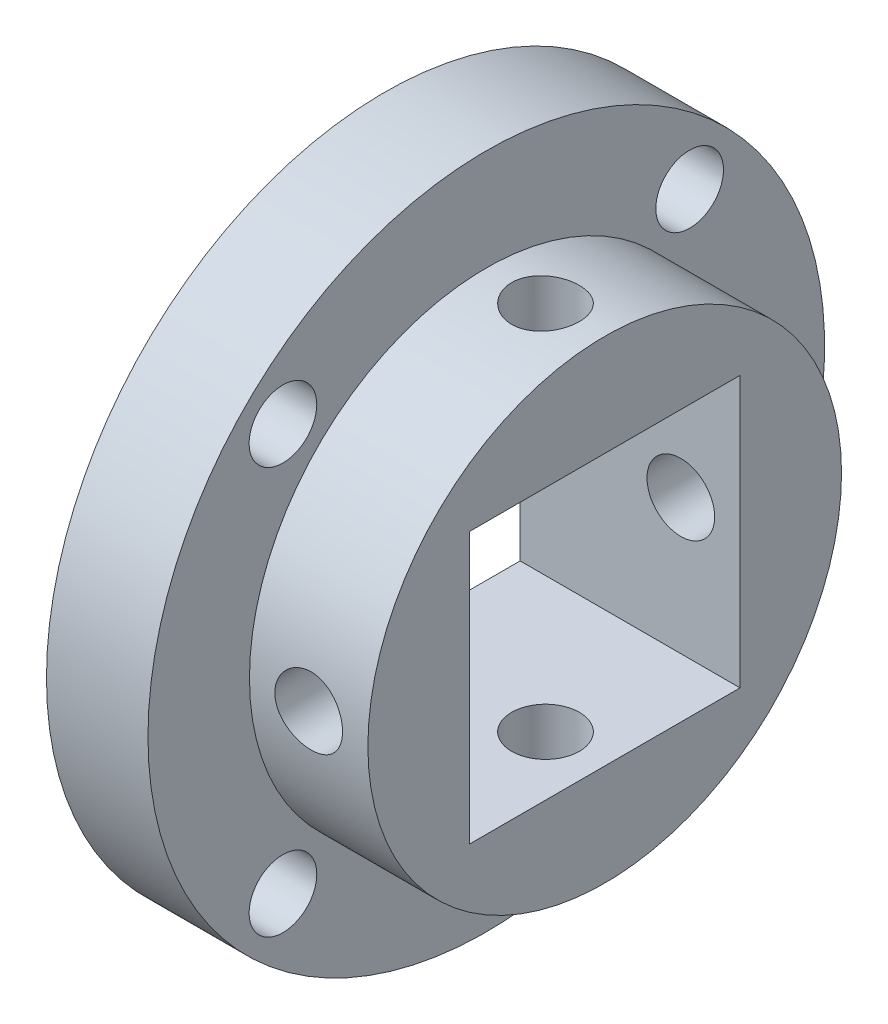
ISO-10303-21;
HEADER;
FILE_DESCRIPTION(('STEP AP214'),'2;1');
FILE_NAME('part.step','',(''),(''),'','','');
FILE_SCHEMA(('AUTOMOTIVE_DESIGN { 1 0 10303 214 1 1 1 1 }'));
ENDSEC;
DATA;
#1=APPLICATION_CONTEXT('core data for automotive mechanical design processes');
#2=APPLICATION_PROTOCOL_DEFINITION('international standard','automotive_design',2000,#1);
#3=PRODUCT_CONTEXT('',#1,'mechanical');
#4=PRODUCT('Part','Part','',(#3));
#5=PRODUCT_RELATED_PRODUCT_CATEGORY('part','',(#4));
#6=PRODUCT_DEFINITION_FORMATION('','',#4);
#7=PRODUCT_DEFINITION_CONTEXT('part definition',#1,'design');
#8=PRODUCT_DEFINITION('design','',#6,#7);
#9=PRODUCT_DEFINITION_SHAPE('','',#8);
#10=(LENGTH_UNIT() NAMED_UNIT(*) SI_UNIT(.MILLI.,.METRE.));
#11=(NAMED_UNIT(*) PLANE_ANGLE_UNIT() SI_UNIT($,.RADIAN.));
#12=(NAMED_UNIT(*) SI_UNIT($,.STERADIAN.) SOLID_ANGLE_UNIT());
#13=UNCERTAINTY_MEASURE_WITH_UNIT(LENGTH_MEASURE(1.E-05),#10,'distance_accuracy_value','');
#14=(GEOMETRIC_REPRESENTATION_CONTEXT(3) GLOBAL_UNCERTAINTY_ASSIGNED_CONTEXT((#13)) GLOBAL_UNIT_ASSIGNED_CONTEXT((#10,
#11,#12)) REPRESENTATION_CONTEXT('',''));
#15=CARTESIAN_POINT('',(0.,0.,0.));
#16=DIRECTION('',(0.,0.,1.));
#17=DIRECTION('',(1.,0.,0.));
#18=AXIS2_PLACEMENT_3D('',#15,#16,#17);
#19=CARTESIAN_POINT('',(0.,0.,0.));
#20=DIRECTION('',(1.,0.,0.));
#21=DIRECTION('',(0.,0.,-1.));
#22=AXIS2_PLACEMENT_3D('',#19,#20,#21);
#23=PLANE('',#22);
#24=CARTESIAN_POINT('',(0.,-12.0208152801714,12.0208152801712));
#25=DIRECTION('',(1.,0.,0.));
#26=DIRECTION('',(0.,0.,-1.));
#27=AXIS2_PLACEMENT_3D('',#24,#25,#26);
#28=CIRCLE('',#27,2.);
#29=CARTESIAN_POINT('',(0.,-12.0208152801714,10.0208152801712));
#30=VERTEX_POINT('',#29);
#31=EDGE_CURVE('E137',#30,#30,#28,.T.);
#32=ORIENTED_EDGE('',*,*,#31,.T.);
#33=EDGE_LOOP('',(#32));
#34=FACE_BOUND('',#33,.T.);
#35=CARTESIAN_POINT('',(0.,-12.0208152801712,-12.0208152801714));
#36=DIRECTION('',(1.,0.,0.));
#37=DIRECTION('',(0.,0.,-1.));
#38=AXIS2_PLACEMENT_3D('',#35,#36,#37);
#39=CIRCLE('',#38,2.);
#40=CARTESIAN_POINT('',(0.,-12.0208152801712,-14.0208152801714));
#41=VERTEX_POINT('',#40);
#42=EDGE_CURVE('E133',#41,#41,#39,.T.);
#43=ORIENTED_EDGE('',*,*,#42,.T.);
#44=EDGE_LOOP('',(#43));
#45=FACE_BOUND('',#44,.T.);
#46=CARTESIAN_POINT('',(0.,12.0208152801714,-12.0208152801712));
#47=DIRECTION('',(1.,0.,0.));
#48=DIRECTION('',(0.,0.,-1.));
#49=AXIS2_PLACEMENT_3D('',#46,#47,#48);
#50=CIRCLE('',#49,2.);
#51=CARTESIAN_POINT('',(0.,12.0208152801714,-14.0208152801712));
#52=VERTEX_POINT('',#51);
#53=EDGE_CURVE('E129',#52,#52,#50,.T.);
#54=ORIENTED_EDGE('',*,*,#53,.T.);
#55=EDGE_LOOP('',(#54));
#56=FACE_BOUND('',#55,.T.);
#57=CARTESIAN_POINT('',(0.,12.0208152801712,12.0208152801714));
#58=DIRECTION('',(1.,0.,0.));
#59=DIRECTION('',(0.,0.,-1.));
#60=AXIS2_PLACEMENT_3D('',#57,#58,#59);
#61=CIRCLE('',#60,2.);
#62=CARTESIAN_POINT('',(0.,12.0208152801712,10.0208152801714));
#63=VERTEX_POINT('',#62);
#64=EDGE_CURVE('E100',#63,#63,#61,.T.);
#65=ORIENTED_EDGE('',*,*,#64,.T.);
#66=EDGE_LOOP('',(#65));
#67=FACE_BOUND('',#66,.T.);
#68=DIRECTION('',(0.,0.,1.));
#69=VECTOR('',#68,1.);
#70=CARTESIAN_POINT('',(0.,8.,8.));
#71=LINE('',#70,#69);
#72=CARTESIAN_POINT('',(0.,8.,-8.));
#73=VERTEX_POINT('',#72);
#74=CARTESIAN_POINT('',(0.,8.,8.));
#75=VERTEX_POINT('',#74);
#76=EDGE_CURVE('E85',#73,#75,#71,.T.);
#77=ORIENTED_EDGE('',*,*,#76,.T.);
#78=DIRECTION('',(0.,-1.,0.));
#79=VECTOR('',#78,1.);
#80=CARTESIAN_POINT('',(0.,8.,8.));
#81=LINE('',#80,#79);
#82=CARTESIAN_POINT('',(0.,-8.,8.));
#83=VERTEX_POINT('',#82);
#84=EDGE_CURVE('E79',#75,#83,#81,.T.);
#85=ORIENTED_EDGE('',*,*,#84,.T.);
#86=DIRECTION('',(0.,0.,-1.));
#87=VECTOR('',#86,1.);
#88=CARTESIAN_POINT('',(0.,-8.,8.));
#89=LINE('',#88,#87);
#90=CARTESIAN_POINT('',(0.,-8.,-8.));
#91=VERTEX_POINT('',#90);
#92=EDGE_CURVE('E88',#83,#91,#89,.T.);
#93=ORIENTED_EDGE('',*,*,#92,.T.);
#94=DIRECTION('',(0.,1.,0.));
#95=VECTOR('',#94,1.);
#96=CARTESIAN_POINT('',(0.,8.,-8.));
#97=LINE('',#96,#95);
#98=EDGE_CURVE('E51',#91,#73,#97,.T.);
#99=ORIENTED_EDGE('',*,*,#98,.T.);
#100=EDGE_LOOP('',(#77,#85,#93,#99));
#101=FACE_BOUND('',#100,.T.);
#102=CARTESIAN_POINT('',(0.,0.,0.));
#103=DIRECTION('',(-1.,0.,0.));
#104=DIRECTION('',(0.,0.,1.));
#105=AXIS2_PLACEMENT_3D('',#102,#103,#104);
#106=CIRCLE('',#105,20.);
#107=CARTESIAN_POINT('',(0.,0.,20.));
#108=VERTEX_POINT('',#107);
#109=EDGE_CURVE('E11',#108,#108,#106,.T.);
#110=ORIENTED_EDGE('',*,*,#109,.T.);
#111=EDGE_LOOP('',(#110));
#112=FACE_BOUND('',#111,.T.);
#113=ADVANCED_FACE('F35',(#34,#45,#56,#67,#101,#112),#23,.F.);
#114=CARTESIAN_POINT('',(-19.0972157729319,0.,0.));
#115=DIRECTION('',(-1.,0.,0.));
#116=DIRECTION('',(0.,0.,1.));
#117=AXIS2_PLACEMENT_3D('',#114,#115,#116);
#118=CYLINDRICAL_SURFACE('',#117,20.);
#119=ORIENTED_EDGE('',*,*,#109,.F.);
#120=EDGE_LOOP('',(#119));
#121=FACE_BOUND('',#120,.T.);
#122=CARTESIAN_POINT('',(6.,0.,0.));
#123=DIRECTION('',(-1.,0.,0.));
#124=DIRECTION('',(0.,0.,1.));
#125=AXIS2_PLACEMENT_3D('',#122,#123,#124);
#126=CIRCLE('',#125,20.);
#127=CARTESIAN_POINT('',(6.,0.,20.));
#128=VERTEX_POINT('',#127);
#129=EDGE_CURVE('E43',#128,#128,#126,.T.);
#130=ORIENTED_EDGE('',*,*,#129,.T.);
#131=EDGE_LOOP('',(#130));
#132=FACE_BOUND('',#131,.T.);
#133=ADVANCED_FACE('F210',(#121,#132),#118,.T.);
#134=CARTESIAN_POINT('',(6.,-20.,1.39659253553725E-13));
#135=DIRECTION('',(-1.,0.,0.));
#136=DIRECTION('',(0.,0.,1.));
#137=AXIS2_PLACEMENT_3D('',#134,#135,#136);
#138=PLANE('',#137);
#139=CARTESIAN_POINT('',(6.,-12.0208152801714,12.0208152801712));
#140=DIRECTION('',(-1.,0.,0.));
#141=DIRECTION('',(0.,0.,1.));
#142=AXIS2_PLACEMENT_3D('',#139,#140,#141);
#143=CIRCLE('',#142,2.);
#144=CARTESIAN_POINT('',(6.,-12.0208152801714,14.0208152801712));
#145=VERTEX_POINT('',#144);
#146=EDGE_CURVE('E134',#145,#145,#143,.T.);
#147=ORIENTED_EDGE('',*,*,#146,.T.);
#148=EDGE_LOOP('',(#147));
#149=FACE_BOUND('',#148,.T.);
#150=CARTESIAN_POINT('',(6.,-12.0208152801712,-12.0208152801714));
#151=DIRECTION('',(-1.,0.,0.));
#152=DIRECTION('',(0.,0.,1.));
#153=AXIS2_PLACEMENT_3D('',#150,#151,#152);
#154=CIRCLE('',#153,2.);
#155=CARTESIAN_POINT('',(6.,-12.0208152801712,-10.0208152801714));
#156=VERTEX_POINT('',#155);
#157=EDGE_CURVE('E130',#156,#156,#154,.T.);
#158=ORIENTED_EDGE('',*,*,#157,.T.);
#159=EDGE_LOOP('',(#158));
#160=FACE_BOUND('',#159,.T.);
#161=CARTESIAN_POINT('',(6.,12.0208152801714,-12.0208152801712));
#162=DIRECTION('',(-1.,0.,0.));
#163=DIRECTION('',(0.,0.,1.));
#164=AXIS2_PLACEMENT_3D('',#161,#162,#163);
#165=CIRCLE('',#164,2.);
#166=CARTESIAN_POINT('',(6.,12.0208152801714,-10.0208152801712));
#167=VERTEX_POINT('',#166);
#168=EDGE_CURVE('E126',#167,#167,#165,.T.);
#169=ORIENTED_EDGE('',*,*,#168,.T.);
#170=EDGE_LOOP('',(#169));
#171=FACE_BOUND('',#170,.T.);
#172=CARTESIAN_POINT('',(6.,12.0208152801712,12.0208152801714));
#173=DIRECTION('',(-1.,0.,0.));
#174=DIRECTION('',(0.,0.,1.));
#175=AXIS2_PLACEMENT_3D('',#172,#173,#174);
#176=CIRCLE('',#175,2.);
#177=CARTESIAN_POINT('',(6.,12.0208152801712,14.0208152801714));
#178=VERTEX_POINT('',#177);
#179=EDGE_CURVE('E107',#178,#178,#176,.T.);
#180=ORIENTED_EDGE('',*,*,#179,.T.);
#181=EDGE_LOOP('',(#180));
#182=FACE_BOUND('',#181,.T.);
#183=ORIENTED_EDGE('',*,*,#129,.F.);
#184=EDGE_LOOP('',(#183));
#185=FACE_BOUND('',#184,.T.);
#186=CARTESIAN_POINT('',(6.,0.,0.));
#187=DIRECTION('',(-1.,0.,0.));
#188=DIRECTION('',(0.,0.,1.));
#189=AXIS2_PLACEMENT_3D('',#186,#187,#188);
#190=CIRCLE('',#189,14.);
#191=CARTESIAN_POINT('',(6.,0.,14.));
#192=VERTEX_POINT('',#191);
#193=EDGE_CURVE('E119',#192,#192,#190,.T.);
#194=ORIENTED_EDGE('',*,*,#193,.T.);
#195=EDGE_LOOP('',(#194));
#196=FACE_BOUND('',#195,.T.);
#197=ADVANCED_FACE('F207',(#149,#160,#171,#182,#185,#196),#138,.F.);
#198=CARTESIAN_POINT('',(-19.0972157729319,0.,0.));
#199=DIRECTION('',(-1.,0.,0.));
#200=DIRECTION('',(0.,0.,1.));
#201=AXIS2_PLACEMENT_3D('',#198,#199,#200);
#202=CYLINDRICAL_SURFACE('',#201,14.);
#203=CARTESIAN_POINT('',(11.5,0.,14.));
#204=CARTESIAN_POINT('',(11.4999953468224,-0.111730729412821,13.9999982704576));
#205=CARTESIAN_POINT('',(11.4906055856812,-0.223527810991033,13.9986484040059));
#206=CARTESIAN_POINT('',(11.453301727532,-0.44400132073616,13.9933934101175));
#207=CARTESIAN_POINT('',(11.4253691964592,-0.552674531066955,13.9894857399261));
#208=CARTESIAN_POINT('',(11.3518278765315,-0.763677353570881,13.9795546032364));
#209=CARTESIAN_POINT('',(11.306232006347,-0.866011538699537,13.9735326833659));
#210=CARTESIAN_POINT('',(11.1986889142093,-1.06155930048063,13.9600397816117));
#211=CARTESIAN_POINT('',(11.1367441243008,-1.15477423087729,13.9525690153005));
#212=CARTESIAN_POINT('',(10.9977916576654,-1.33011730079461,13.9369507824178));
#213=CARTESIAN_POINT('',(10.9206907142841,-1.41217118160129,13.9287993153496));
#214=CARTESIAN_POINT('',(10.7538151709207,-1.56222258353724,13.9127699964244));
#215=CARTESIAN_POINT('',(10.6640398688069,-1.63021932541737,13.9048921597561));
#216=CARTESIAN_POINT('',(10.4738697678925,-1.75051175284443,13.8902631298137));
#217=CARTESIAN_POINT('',(10.3734295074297,-1.80273625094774,13.8835171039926));
#218=CARTESIAN_POINT('',(10.1650909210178,-1.88954690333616,13.8719696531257));
#219=CARTESIAN_POINT('',(10.0571929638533,-1.92413392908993,13.8671681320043));
#220=CARTESIAN_POINT('',(9.83777998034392,-1.97445864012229,13.8600923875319));
#221=CARTESIAN_POINT('',(9.72629456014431,-1.99032297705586,13.8578011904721));
#222=CARTESIAN_POINT('',(9.50222218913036,-2.00314420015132,13.8559538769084));
#223=CARTESIAN_POINT('',(9.38963529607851,-2.00010207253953,13.8563976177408));
#224=CARTESIAN_POINT('',(9.16744690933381,-1.97530036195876,13.8599545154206));
#225=CARTESIAN_POINT('',(9.05782935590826,-1.95368136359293,13.8630476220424));
#226=CARTESIAN_POINT('',(8.84379382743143,-1.89255944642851,13.8715234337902));
#227=CARTESIAN_POINT('',(8.73937598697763,-1.85305606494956,13.8769061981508));
#228=CARTESIAN_POINT('',(8.53827345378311,-1.757139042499,13.8893771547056));
#229=CARTESIAN_POINT('',(8.44161777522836,-1.7006653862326,13.8964713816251));
#230=CARTESIAN_POINT('',(8.25910157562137,-1.57245369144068,13.9115614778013));
#231=CARTESIAN_POINT('',(8.17324169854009,-1.50071474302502,13.9195574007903));
#232=CARTESIAN_POINT('',(8.01393919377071,-1.34323491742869,13.935638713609));
#233=CARTESIAN_POINT('',(7.94061610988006,-1.25737307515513,13.9437242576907));
#234=CARTESIAN_POINT('',(7.80940299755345,-1.07449831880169,13.9590063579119));
#235=CARTESIAN_POINT('',(7.75151302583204,-0.977485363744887,13.9662029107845));
#236=CARTESIAN_POINT('',(7.6528051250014,-0.774962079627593,13.9789027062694));
#237=CARTESIAN_POINT('',(7.61199589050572,-0.669447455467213,13.9844050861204));
#238=CARTESIAN_POINT('',(7.5487090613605,-0.452966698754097,13.9930891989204));
#239=CARTESIAN_POINT('',(7.52623034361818,-0.342000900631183,13.9962710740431));
#240=CARTESIAN_POINT('',(7.50040037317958,-0.118800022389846,13.9999369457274));
#241=CARTESIAN_POINT('',(7.49688467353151,-0.00658433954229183,14.0004441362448));
#242=CARTESIAN_POINT('',(7.5086448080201,0.216834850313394,13.998766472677));
#243=CARTESIAN_POINT('',(7.5239201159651,0.328038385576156,13.9965816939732));
#244=CARTESIAN_POINT('',(7.57269194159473,0.545782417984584,13.989779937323));
#245=CARTESIAN_POINT('',(7.60610885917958,0.652341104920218,13.9851735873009));
#246=CARTESIAN_POINT('',(7.69013173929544,0.858342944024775,13.9740437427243));
#247=CARTESIAN_POINT('',(7.74073844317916,0.957785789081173,13.9675201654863));
#248=CARTESIAN_POINT('',(7.85809381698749,1.14745969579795,13.9532237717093));
#249=CARTESIAN_POINT('',(7.92494742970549,1.23762521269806,13.9454429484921));
#250=CARTESIAN_POINT('',(8.0727520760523,1.40551529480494,13.9295244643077));
#251=CARTESIAN_POINT('',(8.15370384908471,1.48323920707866,13.9213867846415));
#252=CARTESIAN_POINT('',(8.32813670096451,1.62463364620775,13.905598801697));
#253=CARTESIAN_POINT('',(8.42170727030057,1.68819430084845,13.8979526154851));
#254=CARTESIAN_POINT('',(8.61829318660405,1.79869568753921,13.8840847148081));
#255=CARTESIAN_POINT('',(8.72130829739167,1.8456368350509,13.8778629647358));
#256=CARTESIAN_POINT('',(8.93352330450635,1.92139410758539,13.8675777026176));
#257=CARTESIAN_POINT('',(9.04270175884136,1.95026930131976,13.8635071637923));
#258=CARTESIAN_POINT('',(9.26442056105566,1.98926373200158,13.8579660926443));
#259=CARTESIAN_POINT('',(9.37696069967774,1.99938413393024,13.8564953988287));
#260=CARTESIAN_POINT('',(9.60111382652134,2.00055590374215,13.8563261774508));
#261=CARTESIAN_POINT('',(9.71272593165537,1.9917799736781,13.8576025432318));
#262=CARTESIAN_POINT('',(9.93287012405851,1.95577695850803,13.8627292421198));
#263=CARTESIAN_POINT('',(10.0414022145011,1.92854989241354,13.8665795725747));
#264=CARTESIAN_POINT('',(10.2522652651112,1.85647645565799,13.8764118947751));
#265=CARTESIAN_POINT('',(10.3546000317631,1.81164102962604,13.8823925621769));
#266=CARTESIAN_POINT('',(10.5503224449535,1.7056406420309,13.8958134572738));
#267=CARTESIAN_POINT('',(10.6437098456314,1.64447523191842,13.9032537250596));
#268=CARTESIAN_POINT('',(10.819765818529,1.50691947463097,13.9188366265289));
#269=CARTESIAN_POINT('',(10.9023337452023,1.43040092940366,13.9269848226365));
#270=CARTESIAN_POINT('',(11.0535197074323,1.26458151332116,13.9430182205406));
#271=CARTESIAN_POINT('',(11.1221344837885,1.17527766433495,13.9509033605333));
#272=CARTESIAN_POINT('',(11.2437675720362,0.98590342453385,13.9655666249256));
#273=CARTESIAN_POINT('',(11.2967066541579,0.8857817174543,13.9723390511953));
#274=CARTESIAN_POINT('',(11.3849397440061,0.678021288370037,13.9839575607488));
#275=CARTESIAN_POINT('',(11.4202523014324,0.57039060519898,13.9888056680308));
#276=CARTESIAN_POINT('',(11.4640835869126,0.385211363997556,13.9949036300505));
#277=CARTESIAN_POINT('',(11.4775320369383,0.308813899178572,13.9968051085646));
#278=CARTESIAN_POINT('',(11.4954918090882,0.154954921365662,13.9993538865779));
#279=CARTESIAN_POINT('',(11.5000032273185,0.0774934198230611,14.0000011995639));
#280=CARTESIAN_POINT('',(11.5,0.,14.));
#281=B_SPLINE_CURVE_WITH_KNOTS('',3,(#203,#204,#205,#206,#207,#208,#209,#210,#211,#212,#213,
#214,#215,#216,#217,#218,#219,#220,#221,#222,#223,#224,#225,#226,#227,#228,#229,#230,#231,#232,
#233,#234,#235,#236,#237,#238,#239,#240,#241,#242,#243,#244,#245,#246,#247,#248,#249,#250,#251,
#252,#253,#254,#255,#256,#257,#258,#259,#260,#261,#262,#263,#264,#265,#266,#267,#268,#269,#270,
#271,#272,#273,#274,#275,#276,#277,#278,#279,#280),.UNSPECIFIED.,.T.,.F.,(4,2,2,2,2,2,2,2,2,2,2,
2,2,2,2,2,2,2,2,2,2,2,2,2,2,2,2,2,2,2,2,2,2,2,2,2,2,2,4),(0.,0.334909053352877,
0.670151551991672,1.00514932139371,1.34009728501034,1.67717486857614,2.01427113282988,
2.35286688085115,2.69144589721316,3.02772118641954,3.36397893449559,3.69771416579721,
4.03145803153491,4.36639635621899,4.70135465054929,5.03934756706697,5.3773417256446,
5.71550772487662,6.05365300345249,6.38886112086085,6.7240598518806,7.0577995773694,
7.39155369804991,7.7275237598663,8.06351144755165,8.40202124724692,8.74052258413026,
9.07791128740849,9.41527903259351,9.74957651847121,10.0838736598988,10.4179633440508,
10.7520622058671,11.0890764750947,11.4261693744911,11.7649380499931,12.1033494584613,
12.3356358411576,12.5679197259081),.UNSPECIFIED.);
#282=CARTESIAN_POINT('',(11.5,0.,14.));
#283=VERTEX_POINT('',#282);
#284=EDGE_CURVE('E153',#283,#283,#281,.T.);
#285=ORIENTED_EDGE('',*,*,#284,.T.);
#286=EDGE_LOOP('',(#285));
#287=FACE_BOUND('',#286,.T.);
#288=CARTESIAN_POINT('',(9.50000000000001,1.99999999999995,-13.856406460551));
#289=CARTESIAN_POINT('',(9.38827582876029,1.99999534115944,-13.8564082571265));
#290=CARTESIAN_POINT('',(9.27648528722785,1.99060664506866,-13.8577723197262));
#291=CARTESIAN_POINT('',(9.05602536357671,1.95330740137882,-13.8630779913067));
#292=CARTESIAN_POINT('',(8.94735920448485,1.925378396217,-13.8670221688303));
#293=CARTESIAN_POINT('',(8.73637129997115,1.85184738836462,-13.8770324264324));
#294=CARTESIAN_POINT('',(8.63404492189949,1.80625847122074,-13.8830969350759));
#295=CARTESIAN_POINT('',(8.43851027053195,1.69873175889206,-13.8966626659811));
#296=CARTESIAN_POINT('',(8.34530065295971,1.6367963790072,-13.9041636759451));
#297=CARTESIAN_POINT('',(8.16995170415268,1.49785346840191,-13.9198182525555));
#298=CARTESIAN_POINT('',(8.08788828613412,1.42075056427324,-13.9279757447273));
#299=CARTESIAN_POINT('',(7.93781844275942,1.2538670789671,-13.9439890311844));
#300=CARTESIAN_POINT('',(7.86981276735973,1.16408582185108,-13.9518448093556));
#301=CARTESIAN_POINT('',(7.74951090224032,0.973910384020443,-13.9664103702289));
#302=CARTESIAN_POINT('',(7.69728428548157,0.873471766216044,-13.9731150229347));
#303=CARTESIAN_POINT('',(7.61046926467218,0.665136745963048,-13.9845795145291));
#304=CARTESIAN_POINT('',(7.57588001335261,0.557240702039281,-13.9893394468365));
#305=CARTESIAN_POINT('',(7.52555079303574,0.337834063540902,-13.9963505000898));
#306=CARTESIAN_POINT('',(7.50968393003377,0.22635312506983,-13.9986185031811));
#307=CARTESIAN_POINT('',(7.49685610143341,0.00228956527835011,-14.0004479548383));
#308=CARTESIAN_POINT('',(7.49989417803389,-0.110292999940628,-14.0000095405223));
#309=CARTESIAN_POINT('',(7.52468937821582,-0.332498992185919,-13.9964890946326));
#310=CARTESIAN_POINT('',(7.54630999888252,-0.442137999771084,-13.9934263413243));
#311=CARTESIAN_POINT('',(7.60744255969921,-0.656215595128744,-13.9850228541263));
#312=CARTESIAN_POINT('',(7.6469549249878,-0.760654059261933,-13.9796820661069));
#313=CARTESIAN_POINT('',(7.74289074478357,-0.961781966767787,-13.9672894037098));
#314=CARTESIAN_POINT('',(7.79937215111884,-1.05844339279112,-13.9602316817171));
#315=CARTESIAN_POINT('',(7.92760049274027,-1.2409678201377,-13.9451926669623));
#316=CARTESIAN_POINT('',(7.99934834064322,-1.32683017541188,-13.9372113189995));
#317=CARTESIAN_POINT('',(8.156834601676,-1.48612299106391,-13.921132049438));
#318=CARTESIAN_POINT('',(8.2426921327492,-1.55943569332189,-13.9130337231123));
#319=CARTESIAN_POINT('',(8.42555452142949,-1.69062989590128,-13.8977029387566));
#320=CARTESIAN_POINT('',(8.52255943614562,-1.74851131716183,-13.890470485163));
#321=CARTESIAN_POINT('',(8.72508028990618,-1.847213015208,-13.8776905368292));
#322=CARTESIAN_POINT('',(8.83060180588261,-1.88802200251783,-13.8721441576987));
#323=CARTESIAN_POINT('',(9.04709757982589,-1.95130623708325,-13.8633846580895));
#324=CARTESIAN_POINT('',(9.15807149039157,-1.97378265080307,-13.8601713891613));
#325=CARTESIAN_POINT('',(9.38127653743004,-1.99960390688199,-13.8564698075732));
#326=CARTESIAN_POINT('',(9.49348802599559,-2.00311531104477,-13.8559577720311));
#327=CARTESIAN_POINT('',(9.71689780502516,-1.99134808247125,-13.8576537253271));
#328=CARTESIAN_POINT('',(9.8280961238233,-1.97606997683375,-13.8598616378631));
#329=CARTESIAN_POINT('',(10.0458121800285,-1.92729837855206,-13.8667269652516));
#330=CARTESIAN_POINT('',(10.1523487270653,-1.89388715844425,-13.8713733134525));
#331=CARTESIAN_POINT('',(10.3583087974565,-1.80988306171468,-13.8825829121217));
#332=CARTESIAN_POINT('',(10.4577319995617,-1.75928940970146,-13.8891462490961));
#333=CARTESIAN_POINT('',(10.6473918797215,-1.6419536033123,-13.9035064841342));
#334=CARTESIAN_POINT('',(10.7375609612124,-1.5751032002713,-13.911311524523));
#335=CARTESIAN_POINT('',(10.9054597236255,-1.42730277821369,-13.9272509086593));
#336=CARTESIAN_POINT('',(10.9831887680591,-1.34635203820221,-13.9353852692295));
#337=CARTESIAN_POINT('',(11.1245952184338,-1.1719170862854,-13.9511405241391));
#338=CARTESIAN_POINT('',(11.1881625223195,-1.07834317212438,-13.9587570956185));
#339=CARTESIAN_POINT('',(11.2986755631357,-0.881748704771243,-13.972552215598));
#340=CARTESIAN_POINT('',(11.345621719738,-0.778728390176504,-13.9787308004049));
#341=CARTESIAN_POINT('',(11.4213821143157,-0.566515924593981,-13.9889347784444));
#342=CARTESIAN_POINT('',(11.4502575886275,-0.457345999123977,-13.9929674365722));
#343=CARTESIAN_POINT('',(11.4892554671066,-0.235645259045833,-13.9984555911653));
#344=CARTESIAN_POINT('',(11.4993789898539,-0.123114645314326,-13.9999112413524));
#345=CARTESIAN_POINT('',(11.5005602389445,0.101043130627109,-14.0000800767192));
#346=CARTESIAN_POINT('',(11.4917868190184,0.212669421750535,-13.9988175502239));
#347=CARTESIAN_POINT('',(11.455783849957,0.432842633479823,-13.9937406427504));
#348=CARTESIAN_POINT('',(11.4285543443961,0.541389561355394,-13.989926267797));
#349=CARTESIAN_POINT('',(11.3564700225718,0.752283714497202,-13.9801722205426));
#350=CARTESIAN_POINT('',(11.3116258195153,0.854634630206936,-13.9742338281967));
#351=CARTESIAN_POINT('',(11.205602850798,1.05038570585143,-13.9608856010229));
#352=CARTESIAN_POINT('',(11.1444236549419,1.1437856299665,-13.9534757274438));
#353=CARTESIAN_POINT('',(11.0068522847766,1.3198419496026,-13.9379304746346));
#354=CARTESIAN_POINT('',(10.9303350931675,1.40240016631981,-13.9297894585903));
#355=CARTESIAN_POINT('',(10.7645224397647,1.55356716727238,-13.9137422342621));
#356=CARTESIAN_POINT('',(10.6752239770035,1.62217266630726,-13.9058360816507));
#357=CARTESIAN_POINT('',(10.4858545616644,1.74379523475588,-13.8911108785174));
#358=CARTESIAN_POINT('',(10.3857313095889,1.7967315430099,-13.8842975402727));
#359=CARTESIAN_POINT('',(10.1779677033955,1.88495902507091,-13.8725962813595));
#360=CARTESIAN_POINT('',(10.0703354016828,1.92026877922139,-13.8677063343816));
#361=CARTESIAN_POINT('',(9.88516357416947,1.9640925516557,-13.8615529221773));
#362=CARTESIAN_POINT('',(9.80877566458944,1.97753762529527,-13.859633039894));
#363=CARTESIAN_POINT('',(9.65493580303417,1.99549291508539,-13.8570591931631));
#364=CARTESIAN_POINT('',(9.57748386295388,2.00000323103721,-13.8564052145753));
#365=CARTESIAN_POINT('',(9.50000000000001,1.99999999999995,-13.856406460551));
#366=B_SPLINE_CURVE_WITH_KNOTS('',3,(#288,#289,#290,#291,#292,#293,#294,#295,#296,#297,#298,
#299,#300,#301,#302,#303,#304,#305,#306,#307,#308,#309,#310,#311,#312,#313,#314,#315,#316,#317,
#318,#319,#320,#321,#322,#323,#324,#325,#326,#327,#328,#329,#330,#331,#332,#333,#334,#335,#336,
#337,#338,#339,#340,#341,#342,#343,#344,#345,#346,#347,#348,#349,#350,#351,#352,#353,#354,#355,
#356,#357,#358,#359,#360,#361,#362,#363,#364,#365),.UNSPECIFIED.,.T.,.F.,(4,2,2,2,2,2,2,2,2,2,2,
2,2,2,2,2,2,2,2,2,2,2,2,2,2,2,2,2,2,2,2,2,2,2,2,2,2,2,4),(0.,0.334889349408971,
0.670112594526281,1.00508792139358,1.34001378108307,1.67711715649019,2.01423851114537,
2.35282530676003,2.6913958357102,3.02765822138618,3.36390357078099,3.69769984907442,
4.03150405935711,4.36646147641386,4.70143892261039,5.03940517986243,5.37737316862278,
5.7155642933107,6.05373389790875,6.3889286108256,6.72411392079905,7.05779100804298,
7.39148315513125,7.72746121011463,8.063456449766,8.40197921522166,8.74049343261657,
9.07785422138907,9.41519488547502,9.74953375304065,10.083871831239,10.4180087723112,
10.7521545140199,11.0891434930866,11.426211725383,11.7649881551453,12.103406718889,
12.3356645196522,12.5679197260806),.UNSPECIFIED.);
#367=CARTESIAN_POINT('',(9.50000000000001,1.99999999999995,-13.856406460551));
#368=VERTEX_POINT('',#367);
#369=EDGE_CURVE('E148',#368,#368,#366,.T.);
#370=ORIENTED_EDGE('',*,*,#369,.T.);
#371=EDGE_LOOP('',(#370));
#372=FACE_BOUND('',#371,.T.);
#373=CARTESIAN_POINT('',(9.50000000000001,13.856406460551,-2.));
#374=CARTESIAN_POINT('',(9.61172417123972,13.8564082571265,-1.99999534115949));
#375=CARTESIAN_POINT('',(9.72351471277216,13.8577723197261,-1.99060664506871));
#376=CARTESIAN_POINT('',(9.9439746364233,13.8630779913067,-1.95330740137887));
#377=CARTESIAN_POINT('',(10.0526407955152,13.8670221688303,-1.92537839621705));
#378=CARTESIAN_POINT('',(10.2636287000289,13.8770324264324,-1.85184738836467));
#379=CARTESIAN_POINT('',(10.3659550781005,13.8830969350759,-1.80625847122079));
#380=CARTESIAN_POINT('',(10.5614897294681,13.8966626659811,-1.69873175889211));
#381=CARTESIAN_POINT('',(10.6546993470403,13.9041636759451,-1.63679637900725));
#382=CARTESIAN_POINT('',(10.8300482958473,13.9198182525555,-1.49785346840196));
#383=CARTESIAN_POINT('',(10.9121117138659,13.9279757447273,-1.42075056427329));
#384=CARTESIAN_POINT('',(11.0621815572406,13.9439890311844,-1.25386707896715));
#385=CARTESIAN_POINT('',(11.1301872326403,13.9518448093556,-1.16408582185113));
#386=CARTESIAN_POINT('',(11.2504890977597,13.9664103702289,-0.973910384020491));
#387=CARTESIAN_POINT('',(11.3027157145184,13.9731150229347,-0.873471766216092));
#388=CARTESIAN_POINT('',(11.3895307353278,13.9845795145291,-0.665136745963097));
#389=CARTESIAN_POINT('',(11.4241199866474,13.9893394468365,-0.55724070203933));
#390=CARTESIAN_POINT('',(11.4744492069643,13.9963505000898,-0.337834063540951));
#391=CARTESIAN_POINT('',(11.4903160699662,13.9986185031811,-0.226353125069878));
#392=CARTESIAN_POINT('',(11.5031438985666,14.0004479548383,-0.00228956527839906));
#393=CARTESIAN_POINT('',(11.5001058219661,14.0000095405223,0.110292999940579));
#394=CARTESIAN_POINT('',(11.4753106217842,13.9964890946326,0.33249899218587));
#395=CARTESIAN_POINT('',(11.4536900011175,13.9934263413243,0.442137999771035));
#396=CARTESIAN_POINT('',(11.3925574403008,13.9850228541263,0.656215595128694));
#397=CARTESIAN_POINT('',(11.3530450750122,13.9796820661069,0.760654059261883));
#398=CARTESIAN_POINT('',(11.2571092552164,13.9672894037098,0.961781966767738));
#399=CARTESIAN_POINT('',(11.2006278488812,13.9602316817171,1.05844339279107));
#400=CARTESIAN_POINT('',(11.0723995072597,13.9451926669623,1.24096782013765));
#401=CARTESIAN_POINT('',(11.0006516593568,13.9372113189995,1.32683017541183));
#402=CARTESIAN_POINT('',(10.843165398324,13.921132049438,1.48612299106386));
#403=CARTESIAN_POINT('',(10.7573078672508,13.9130337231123,1.55943569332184));
#404=CARTESIAN_POINT('',(10.5744454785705,13.8977029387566,1.69062989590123));
#405=CARTESIAN_POINT('',(10.4774405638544,13.8904704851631,1.74851131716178));
#406=CARTESIAN_POINT('',(10.2749197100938,13.8776905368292,1.84721301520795));
#407=CARTESIAN_POINT('',(10.1693981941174,13.8721441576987,1.88802200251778));
#408=CARTESIAN_POINT('',(9.95290242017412,13.8633846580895,1.9513062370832));
#409=CARTESIAN_POINT('',(9.84192850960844,13.8601713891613,1.97378265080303));
#410=CARTESIAN_POINT('',(9.61872346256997,13.8564698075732,1.99960390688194));
#411=CARTESIAN_POINT('',(9.50651197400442,13.8559577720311,2.00311531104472));
#412=CARTESIAN_POINT('',(9.28310219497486,13.8576537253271,1.99134808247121));
#413=CARTESIAN_POINT('',(9.17190387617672,13.8598616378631,1.9760699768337));
#414=CARTESIAN_POINT('',(8.95418781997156,13.8667269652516,1.92729837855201));
#415=CARTESIAN_POINT('',(8.84765127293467,13.8713733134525,1.89388715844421));
#416=CARTESIAN_POINT('',(8.64169120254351,13.8825829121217,1.80988306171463));
#417=CARTESIAN_POINT('',(8.54226800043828,13.8891462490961,1.75928940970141));
#418=CARTESIAN_POINT('',(8.35260812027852,13.9035064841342,1.64195360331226));
#419=CARTESIAN_POINT('',(8.26243903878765,13.911311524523,1.57510320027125));
#420=CARTESIAN_POINT('',(8.09454027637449,13.9272509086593,1.42730277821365));
#421=CARTESIAN_POINT('',(8.01681123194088,13.9353852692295,1.34635203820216));
#422=CARTESIAN_POINT('',(7.87540478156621,13.9511405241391,1.17191708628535));
#423=CARTESIAN_POINT('',(7.81183747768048,13.9587570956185,1.07834317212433));
#424=CARTESIAN_POINT('',(7.70132443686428,13.972552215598,0.881748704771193));
#425=CARTESIAN_POINT('',(7.65437828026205,13.9787308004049,0.778728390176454));
#426=CARTESIAN_POINT('',(7.57861788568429,13.9889347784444,0.566515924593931));
#427=CARTESIAN_POINT('',(7.54974241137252,13.9929674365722,0.457345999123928));
#428=CARTESIAN_POINT('',(7.5107445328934,13.9984555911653,0.235645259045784));
#429=CARTESIAN_POINT('',(7.50062101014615,13.9999112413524,0.123114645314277));
#430=CARTESIAN_POINT('',(7.49943976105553,14.0000800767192,-0.101043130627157));
#431=CARTESIAN_POINT('',(7.50821318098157,13.9988175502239,-0.212669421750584));
#432=CARTESIAN_POINT('',(7.54421615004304,13.9937406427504,-0.432842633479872));
#433=CARTESIAN_POINT('',(7.57144565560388,13.989926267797,-0.541389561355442));
#434=CARTESIAN_POINT('',(7.6435299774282,13.9801722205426,-0.752283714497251));
#435=CARTESIAN_POINT('',(7.68837418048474,13.9742338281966,-0.854634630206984));
#436=CARTESIAN_POINT('',(7.79439714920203,13.9608856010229,-1.05038570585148));
#437=CARTESIAN_POINT('',(7.85557634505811,13.9534757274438,-1.14378562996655));
#438=CARTESIAN_POINT('',(7.99314771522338,13.9379304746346,-1.31984194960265));
#439=CARTESIAN_POINT('',(8.0696649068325,13.9297894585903,-1.40240016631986));
#440=CARTESIAN_POINT('',(8.23547756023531,13.9137422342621,-1.55356716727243));
#441=CARTESIAN_POINT('',(8.32477602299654,13.9058360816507,-1.6221726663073));
#442=CARTESIAN_POINT('',(8.51414543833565,13.8911108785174,-1.74379523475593));
#443=CARTESIAN_POINT('',(8.61426869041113,13.8842975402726,-1.79673154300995));
#444=CARTESIAN_POINT('',(8.82203229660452,13.8725962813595,-1.88495902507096));
#445=CARTESIAN_POINT('',(8.9296645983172,13.8677063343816,-1.92026877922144));
#446=CARTESIAN_POINT('',(9.11483642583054,13.8615529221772,-1.96409255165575));
#447=CARTESIAN_POINT('',(9.19122433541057,13.859633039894,-1.97753762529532));
#448=CARTESIAN_POINT('',(9.34506419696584,13.857059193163,-1.99549291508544));
#449=CARTESIAN_POINT('',(9.42251613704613,13.8564052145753,-2.00000323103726));
#450=CARTESIAN_POINT('',(9.50000000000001,13.856406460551,-2.));
#451=B_SPLINE_CURVE_WITH_KNOTS('',3,(#373,#374,#375,#376,#377,#378,#379,#380,#381,#382,#383,
#384,#385,#386,#387,#388,#389,#390,#391,#392,#393,#394,#395,#396,#397,#398,#399,#400,#401,#402,
#403,#404,#405,#406,#407,#408,#409,#410,#411,#412,#413,#414,#415,#416,#417,#418,#419,#420,#421,
#422,#423,#424,#425,#426,#427,#428,#429,#430,#431,#432,#433,#434,#435,#436,#437,#438,#439,#440,
#441,#442,#443,#444,#445,#446,#447,#448,#449,#450),.UNSPECIFIED.,.T.,.F.,(4,2,2,2,2,2,2,2,2,2,2,
2,2,2,2,2,2,2,2,2,2,2,2,2,2,2,2,2,2,2,2,2,2,2,2,2,2,2,4),(0.,0.334889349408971,
0.670112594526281,1.00508792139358,1.34001378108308,1.67711715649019,2.01423851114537,
2.35282530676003,2.6913958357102,3.02765822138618,3.36390357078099,3.69769984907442,
4.03150405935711,4.36646147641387,4.70143892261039,5.03940517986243,5.37737316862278,
5.7155642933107,6.05373389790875,6.3889286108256,6.72411392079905,7.05779100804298,
7.39148315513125,7.72746121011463,8.06345644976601,8.40197921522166,8.74049343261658,
9.07785422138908,9.41519488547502,9.74953375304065,10.083871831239,10.4180087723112,
10.7521545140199,11.0891434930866,11.426211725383,11.7649881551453,12.103406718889,
12.3356645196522,12.5679197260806),.UNSPECIFIED.);
#452=CARTESIAN_POINT('',(9.50000000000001,13.856406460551,-2.));
#453=VERTEX_POINT('',#452);
#454=EDGE_CURVE('E141',#453,#453,#451,.T.);
#455=ORIENTED_EDGE('',*,*,#454,.T.);
#456=EDGE_LOOP('',(#455));
#457=FACE_BOUND('',#456,.T.);
#458=CARTESIAN_POINT('',(9.50000000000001,-13.856406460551,2.));
#459=CARTESIAN_POINT('',(9.61172417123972,-13.8564082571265,1.99999534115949));
#460=CARTESIAN_POINT('',(9.72351471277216,-13.8577723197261,1.99060664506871));
#461=CARTESIAN_POINT('',(9.9439746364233,-13.8630779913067,1.95330740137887));
#462=CARTESIAN_POINT('',(10.0526407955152,-13.8670221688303,1.92537839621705));
#463=CARTESIAN_POINT('',(10.2636287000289,-13.8770324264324,1.85184738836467));
#464=CARTESIAN_POINT('',(10.3659550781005,-13.8830969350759,1.80625847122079));
#465=CARTESIAN_POINT('',(10.5614897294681,-13.8966626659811,1.69873175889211));
#466=CARTESIAN_POINT('',(10.6546993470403,-13.9041636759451,1.63679637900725));
#467=CARTESIAN_POINT('',(10.8300482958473,-13.9198182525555,1.49785346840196));
#468=CARTESIAN_POINT('',(10.9121117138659,-13.9279757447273,1.42075056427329));
#469=CARTESIAN_POINT('',(11.0621815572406,-13.9439890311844,1.25386707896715));
#470=CARTESIAN_POINT('',(11.1301872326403,-13.9518448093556,1.16408582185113));
#471=CARTESIAN_POINT('',(11.2504890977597,-13.9664103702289,0.973910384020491));
#472=CARTESIAN_POINT('',(11.3027157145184,-13.9731150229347,0.873471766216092));
#473=CARTESIAN_POINT('',(11.3895307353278,-13.9845795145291,0.665136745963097));
#474=CARTESIAN_POINT('',(11.4241199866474,-13.9893394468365,0.55724070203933));
#475=CARTESIAN_POINT('',(11.4744492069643,-13.9963505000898,0.337834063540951));
#476=CARTESIAN_POINT('',(11.4903160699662,-13.9986185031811,0.226353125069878));
#477=CARTESIAN_POINT('',(11.5031438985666,-14.0004479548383,0.00228956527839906));
#478=CARTESIAN_POINT('',(11.5001058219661,-14.0000095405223,-0.110292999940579));
#479=CARTESIAN_POINT('',(11.4753106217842,-13.9964890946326,-0.33249899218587));
#480=CARTESIAN_POINT('',(11.4536900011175,-13.9934263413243,-0.442137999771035));
#481=CARTESIAN_POINT('',(11.3925574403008,-13.9850228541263,-0.656215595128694));
#482=CARTESIAN_POINT('',(11.3530450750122,-13.9796820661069,-0.760654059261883));
#483=CARTESIAN_POINT('',(11.2571092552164,-13.9672894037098,-0.961781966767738));
#484=CARTESIAN_POINT('',(11.2006278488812,-13.9602316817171,-1.05844339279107));
#485=CARTESIAN_POINT('',(11.0723995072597,-13.9451926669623,-1.24096782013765));
#486=CARTESIAN_POINT('',(11.0006516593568,-13.9372113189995,-1.32683017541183));
#487=CARTESIAN_POINT('',(10.843165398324,-13.921132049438,-1.48612299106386));
#488=CARTESIAN_POINT('',(10.7573078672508,-13.9130337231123,-1.55943569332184));
#489=CARTESIAN_POINT('',(10.5744454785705,-13.8977029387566,-1.69062989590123));
#490=CARTESIAN_POINT('',(10.4774405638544,-13.8904704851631,-1.74851131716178));
#491=CARTESIAN_POINT('',(10.2749197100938,-13.8776905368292,-1.84721301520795));
#492=CARTESIAN_POINT('',(10.1693981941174,-13.8721441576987,-1.88802200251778));
#493=CARTESIAN_POINT('',(9.95290242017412,-13.8633846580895,-1.9513062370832));
#494=CARTESIAN_POINT('',(9.84192850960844,-13.8601713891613,-1.97378265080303));
#495=CARTESIAN_POINT('',(9.61872346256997,-13.8564698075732,-1.99960390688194));
#496=CARTESIAN_POINT('',(9.50651197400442,-13.8559577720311,-2.00311531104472));
#497=CARTESIAN_POINT('',(9.28310219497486,-13.8576537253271,-1.99134808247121));
#498=CARTESIAN_POINT('',(9.17190387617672,-13.8598616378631,-1.9760699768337));
#499=CARTESIAN_POINT('',(8.95418781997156,-13.8667269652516,-1.92729837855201));
#500=CARTESIAN_POINT('',(8.84765127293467,-13.8713733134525,-1.89388715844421));
#501=CARTESIAN_POINT('',(8.64169120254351,-13.8825829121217,-1.80988306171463));
#502=CARTESIAN_POINT('',(8.54226800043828,-13.8891462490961,-1.75928940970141));
#503=CARTESIAN_POINT('',(8.35260812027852,-13.9035064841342,-1.64195360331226));
#504=CARTESIAN_POINT('',(8.26243903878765,-13.911311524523,-1.57510320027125));
#505=CARTESIAN_POINT('',(8.09454027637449,-13.9272509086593,-1.42730277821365));
#506=CARTESIAN_POINT('',(8.01681123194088,-13.9353852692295,-1.34635203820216));
#507=CARTESIAN_POINT('',(7.87540478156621,-13.9511405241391,-1.17191708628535));
#508=CARTESIAN_POINT('',(7.81183747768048,-13.9587570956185,-1.07834317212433));
#509=CARTESIAN_POINT('',(7.70132443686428,-13.972552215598,-0.881748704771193));
#510=CARTESIAN_POINT('',(7.65437828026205,-13.9787308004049,-0.778728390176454));
#511=CARTESIAN_POINT('',(7.57861788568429,-13.9889347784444,-0.566515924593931));
#512=CARTESIAN_POINT('',(7.54974241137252,-13.9929674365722,-0.457345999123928));
#513=CARTESIAN_POINT('',(7.5107445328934,-13.9984555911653,-0.235645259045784));
#514=CARTESIAN_POINT('',(7.50062101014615,-13.9999112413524,-0.123114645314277));
#515=CARTESIAN_POINT('',(7.49943976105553,-14.0000800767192,0.101043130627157));
#516=CARTESIAN_POINT('',(7.50821318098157,-13.9988175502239,0.212669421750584));
#517=CARTESIAN_POINT('',(7.54421615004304,-13.9937406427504,0.432842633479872));
#518=CARTESIAN_POINT('',(7.57144565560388,-13.989926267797,0.541389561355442));
#519=CARTESIAN_POINT('',(7.6435299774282,-13.9801722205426,0.752283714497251));
#520=CARTESIAN_POINT('',(7.68837418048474,-13.9742338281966,0.854634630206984));
#521=CARTESIAN_POINT('',(7.79439714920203,-13.9608856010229,1.05038570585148));
#522=CARTESIAN_POINT('',(7.85557634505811,-13.9534757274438,1.14378562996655));
#523=CARTESIAN_POINT('',(7.99314771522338,-13.9379304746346,1.31984194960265));
#524=CARTESIAN_POINT('',(8.0696649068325,-13.9297894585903,1.40240016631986));
#525=CARTESIAN_POINT('',(8.23547756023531,-13.9137422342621,1.55356716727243));
#526=CARTESIAN_POINT('',(8.32477602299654,-13.9058360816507,1.6221726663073));
#527=CARTESIAN_POINT('',(8.51414543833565,-13.8911108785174,1.74379523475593));
#528=CARTESIAN_POINT('',(8.61426869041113,-13.8842975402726,1.79673154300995));
#529=CARTESIAN_POINT('',(8.82203229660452,-13.8725962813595,1.88495902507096));
#530=CARTESIAN_POINT('',(8.9296645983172,-13.8677063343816,1.92026877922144));
#531=CARTESIAN_POINT('',(9.11483642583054,-13.8615529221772,1.96409255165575));
#532=CARTESIAN_POINT('',(9.19122433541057,-13.859633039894,1.97753762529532));
#533=CARTESIAN_POINT('',(9.34506419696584,-13.857059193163,1.99549291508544));
#534=CARTESIAN_POINT('',(9.42251613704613,-13.8564052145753,2.00000323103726));
#535=CARTESIAN_POINT('',(9.50000000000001,-13.856406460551,2.));
#536=B_SPLINE_CURVE_WITH_KNOTS('',3,(#458,#459,#460,#461,#462,#463,#464,#465,#466,#467,#468,
#469,#470,#471,#472,#473,#474,#475,#476,#477,#478,#479,#480,#481,#482,#483,#484,#485,#486,#487,
#488,#489,#490,#491,#492,#493,#494,#495,#496,#497,#498,#499,#500,#501,#502,#503,#504,#505,#506,
#507,#508,#509,#510,#511,#512,#513,#514,#515,#516,#517,#518,#519,#520,#521,#522,#523,#524,#525,
#526,#527,#528,#529,#530,#531,#532,#533,#534,#535),.UNSPECIFIED.,.T.,.F.,(4,2,2,2,2,2,2,2,2,2,2,
2,2,2,2,2,2,2,2,2,2,2,2,2,2,2,2,2,2,2,2,2,2,2,2,2,2,2,4),(0.,0.334889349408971,
0.670112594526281,1.00508792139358,1.34001378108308,1.67711715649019,2.01423851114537,
2.35282530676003,2.6913958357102,3.02765822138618,3.36390357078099,3.69769984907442,
4.03150405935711,4.36646147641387,4.70143892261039,5.03940517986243,5.37737316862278,
5.7155642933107,6.05373389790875,6.3889286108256,6.72411392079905,7.05779100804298,
7.39148315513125,7.72746121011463,8.06345644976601,8.40197921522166,8.74049343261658,
9.07785422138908,9.41519488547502,9.74953375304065,10.083871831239,10.4180087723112,
10.7521545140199,11.0891434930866,11.426211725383,11.7649881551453,12.103406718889,
12.3356645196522,12.5679197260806),.UNSPECIFIED.);
#537=CARTESIAN_POINT('',(9.50000000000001,-13.856406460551,2.));
#538=VERTEX_POINT('',#537);
#539=EDGE_CURVE('E140',#538,#538,#536,.T.);
#540=ORIENTED_EDGE('',*,*,#539,.T.);
#541=EDGE_LOOP('',(#540));
#542=FACE_BOUND('',#541,.T.);
#543=ORIENTED_EDGE('',*,*,#193,.F.);
#544=EDGE_LOOP('',(#543));
#545=FACE_BOUND('',#544,.T.);
#546=CARTESIAN_POINT('',(13.,0.,0.));
#547=DIRECTION('',(-1.,0.,0.));
#548=DIRECTION('',(0.,0.,1.));
#549=AXIS2_PLACEMENT_3D('',#546,#547,#548);
#550=CIRCLE('',#549,14.);
#551=CARTESIAN_POINT('',(13.,0.,14.));
#552=VERTEX_POINT('',#551);
#553=EDGE_CURVE('E113',#552,#552,#550,.T.);
#554=ORIENTED_EDGE('',*,*,#553,.T.);
#555=EDGE_LOOP('',(#554));
#556=FACE_BOUND('',#555,.T.);
#557=ADVANCED_FACE('F163',(#287,#372,#457,#542,#545,#556),#202,.T.);
#558=CARTESIAN_POINT('',(13.,0.,0.));
#559=DIRECTION('',(-1.,0.,0.));
#560=DIRECTION('',(0.,0.,1.));
#561=AXIS2_PLACEMENT_3D('',#558,#559,#560);
#562=PLANE('',#561);
#563=DIRECTION('',(0.,0.,-1.));
#564=VECTOR('',#563,1.);
#565=CARTESIAN_POINT('',(13.,-8.,8.));
#566=LINE('',#565,#564);
#567=CARTESIAN_POINT('',(13.,-8.,8.));
#568=VERTEX_POINT('',#567);
#569=CARTESIAN_POINT('',(13.,-8.,-8.));
#570=VERTEX_POINT('',#569);
#571=EDGE_CURVE('E106',#568,#570,#566,.T.);
#572=ORIENTED_EDGE('',*,*,#571,.F.);
#573=DIRECTION('',(0.,-1.,0.));
#574=VECTOR('',#573,1.);
#575=CARTESIAN_POINT('',(13.,8.,8.));
#576=LINE('',#575,#574);
#577=CARTESIAN_POINT('',(13.,8.,8.));
#578=VERTEX_POINT('',#577);
#579=EDGE_CURVE('E59',#578,#568,#576,.T.);
#580=ORIENTED_EDGE('',*,*,#579,.F.);
#581=DIRECTION('',(0.,0.,1.));
#582=VECTOR('',#581,1.);
#583=CARTESIAN_POINT('',(13.,8.,8.));
#584=LINE('',#583,#582);
#585=CARTESIAN_POINT('',(13.,8.,-8.));
#586=VERTEX_POINT('',#585);
#587=EDGE_CURVE('E94',#586,#578,#584,.T.);
#588=ORIENTED_EDGE('',*,*,#587,.F.);
#589=DIRECTION('',(0.,1.,0.));
#590=VECTOR('',#589,1.);
#591=CARTESIAN_POINT('',(13.,8.,-8.));
#592=LINE('',#591,#590);
#593=EDGE_CURVE('E97',#570,#586,#592,.T.);
#594=ORIENTED_EDGE('',*,*,#593,.F.);
#595=EDGE_LOOP('',(#572,#580,#588,#594));
#596=FACE_BOUND('',#595,.T.);
#597=ORIENTED_EDGE('',*,*,#553,.F.);
#598=EDGE_LOOP('',(#597));
#599=FACE_BOUND('',#598,.T.);
#600=ADVANCED_FACE('F220',(#596,#599),#562,.F.);
#601=CARTESIAN_POINT('',(0.,8.,8.));
#602=DIRECTION('',(0.,0.,1.));
#603=DIRECTION('',(0.,-1.,0.));
#604=AXIS2_PLACEMENT_3D('',#601,#602,#603);
#605=PLANE('',#604);
#606=CARTESIAN_POINT('',(9.50000000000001,0.,8.));
#607=DIRECTION('',(0.,0.,1.));
#608=DIRECTION('',(0.,-1.,0.));
#609=AXIS2_PLACEMENT_3D('',#606,#607,#608);
#610=CIRCLE('',#609,2.);
#611=CARTESIAN_POINT('',(9.50000000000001,-1.99999999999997,8.));
#612=VERTEX_POINT('',#611);
#613=EDGE_CURVE('E144',#612,#612,#610,.T.);
#614=ORIENTED_EDGE('',*,*,#613,.T.);
#615=EDGE_LOOP('',(#614));
#616=FACE_BOUND('',#615,.T.);
#617=ORIENTED_EDGE('',*,*,#579,.T.);
#618=DIRECTION('',(1.,0.,0.));
#619=VECTOR('',#618,1.);
#620=CARTESIAN_POINT('',(0.,-8.,8.));
#621=LINE('',#620,#619);
#622=EDGE_CURVE('E75',#83,#568,#621,.T.);
#623=ORIENTED_EDGE('',*,*,#622,.F.);
#624=ORIENTED_EDGE('',*,*,#84,.F.);
#625=DIRECTION('',(1.,0.,0.));
#626=VECTOR('',#625,1.);
#627=CARTESIAN_POINT('',(0.,8.,8.));
#628=LINE('',#627,#626);
#629=EDGE_CURVE('E111',#75,#578,#628,.T.);
#630=ORIENTED_EDGE('',*,*,#629,.T.);
#631=EDGE_LOOP('',(#617,#623,#624,#630));
#632=FACE_BOUND('',#631,.T.);
#633=ADVANCED_FACE('F77',(#616,#632),#605,.F.);
#634=CARTESIAN_POINT('',(0.,8.,8.));
#635=DIRECTION('',(0.,1.,0.));
#636=DIRECTION('',(0.,0.,1.));
#637=AXIS2_PLACEMENT_3D('',#634,#635,#636);
#638=PLANE('',#637);
#639=CARTESIAN_POINT('',(9.50000000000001,8.,0.));
#640=DIRECTION('',(0.,1.,0.));
#641=DIRECTION('',(0.,0.,1.));
#642=AXIS2_PLACEMENT_3D('',#639,#640,#641);
#643=CIRCLE('',#642,2.);
#644=CARTESIAN_POINT('',(9.50000000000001,8.,2.));
#645=VERTEX_POINT('',#644);
#646=EDGE_CURVE('E38',#645,#645,#643,.T.);
#647=ORIENTED_EDGE('',*,*,#646,.T.);
#648=EDGE_LOOP('',(#647));
#649=FACE_BOUND('',#648,.T.);
#650=ORIENTED_EDGE('',*,*,#587,.T.);
#651=ORIENTED_EDGE('',*,*,#629,.F.);
#652=ORIENTED_EDGE('',*,*,#76,.F.);
#653=DIRECTION('',(1.,0.,0.));
#654=VECTOR('',#653,1.);
#655=CARTESIAN_POINT('',(0.,8.,-8.));
#656=LINE('',#655,#654);
#657=EDGE_CURVE('E114',#73,#586,#656,.T.);
#658=ORIENTED_EDGE('',*,*,#657,.T.);
#659=EDGE_LOOP('',(#650,#651,#652,#658));
#660=FACE_BOUND('',#659,.T.);
#661=ADVANCED_FACE('F229',(#649,#660),#638,.F.);
#662=CARTESIAN_POINT('',(0.,8.,-8.));
#663=DIRECTION('',(0.,0.,-1.));
#664=DIRECTION('',(-1.,0.,0.));
#665=AXIS2_PLACEMENT_3D('',#662,#663,#664);
#666=PLANE('',#665);
#667=CARTESIAN_POINT('',(9.50000000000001,0.,-8.));
#668=DIRECTION('',(0.,0.,-1.));
#669=DIRECTION('',(-1.,0.,0.));
#670=AXIS2_PLACEMENT_3D('',#667,#668,#669);
#671=CIRCLE('',#670,2.);
#672=CARTESIAN_POINT('',(7.50000000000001,0.,-8.));
#673=VERTEX_POINT('',#672);
#674=EDGE_CURVE('E142',#673,#673,#671,.T.);
#675=ORIENTED_EDGE('',*,*,#674,.T.);
#676=EDGE_LOOP('',(#675));
#677=FACE_BOUND('',#676,.T.);
#678=ORIENTED_EDGE('',*,*,#593,.T.);
#679=ORIENTED_EDGE('',*,*,#657,.F.);
#680=ORIENTED_EDGE('',*,*,#98,.F.);
#681=DIRECTION('',(1.,0.,0.));
#682=VECTOR('',#681,1.);
#683=CARTESIAN_POINT('',(0.,-8.,-8.));
#684=LINE('',#683,#682);
#685=EDGE_CURVE('E84',#91,#570,#684,.T.);
#686=ORIENTED_EDGE('',*,*,#685,.T.);
#687=EDGE_LOOP('',(#678,#679,#680,#686));
#688=FACE_BOUND('',#687,.T.);
#689=ADVANCED_FACE('F255',(#677,#688),#666,.F.);
#690=CARTESIAN_POINT('',(0.,-8.,8.));
#691=DIRECTION('',(0.,-1.,0.));
#692=DIRECTION('',(0.,0.,-1.));
#693=AXIS2_PLACEMENT_3D('',#690,#691,#692);
#694=PLANE('',#693);
#695=CARTESIAN_POINT('',(9.50000000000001,-8.,0.));
#696=DIRECTION('',(0.,-1.,0.));
#697=DIRECTION('',(0.,0.,-1.));
#698=AXIS2_PLACEMENT_3D('',#695,#696,#697);
#699=CIRCLE('',#698,2.);
#700=CARTESIAN_POINT('',(9.50000000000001,-8.,-2.));
#701=VERTEX_POINT('',#700);
#702=EDGE_CURVE('E138',#701,#701,#699,.T.);
#703=ORIENTED_EDGE('',*,*,#702,.T.);
#704=EDGE_LOOP('',(#703));
#705=FACE_BOUND('',#704,.T.);
#706=ORIENTED_EDGE('',*,*,#571,.T.);
#707=ORIENTED_EDGE('',*,*,#685,.F.);
#708=ORIENTED_EDGE('',*,*,#92,.F.);
#709=ORIENTED_EDGE('',*,*,#622,.T.);
#710=EDGE_LOOP('',(#706,#707,#708,#709));
#711=FACE_BOUND('',#710,.T.);
#712=ADVANCED_FACE('F89',(#705,#711),#694,.F.);
#713=CARTESIAN_POINT('',(0.,12.0208152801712,12.0208152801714));
#714=DIRECTION('',(1.,0.,0.));
#715=DIRECTION('',(0.,0.,-1.));
#716=AXIS2_PLACEMENT_3D('',#713,#714,#715);
#717=CYLINDRICAL_SURFACE('',#716,2.);
#718=ORIENTED_EDGE('',*,*,#64,.F.);
#719=EDGE_LOOP('',(#718));
#720=FACE_BOUND('',#719,.T.);
#721=ORIENTED_EDGE('',*,*,#179,.F.);
#722=EDGE_LOOP('',(#721));
#723=FACE_BOUND('',#722,.T.);
#724=ADVANCED_FACE('F203',(#720,#723),#717,.F.);
#725=CARTESIAN_POINT('',(0.,12.0208152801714,-12.0208152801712));
#726=DIRECTION('',(1.,0.,0.));
#727=DIRECTION('',(0.,0.,-1.));
#728=AXIS2_PLACEMENT_3D('',#725,#726,#727);
#729=CYLINDRICAL_SURFACE('',#728,2.);
#730=ORIENTED_EDGE('',*,*,#53,.F.);
#731=EDGE_LOOP('',(#730));
#732=FACE_BOUND('',#731,.T.);
#733=ORIENTED_EDGE('',*,*,#168,.F.);
#734=EDGE_LOOP('',(#733));
#735=FACE_BOUND('',#734,.T.);
#736=ADVANCED_FACE('F199',(#732,#735),#729,.F.);
#737=CARTESIAN_POINT('',(0.,-12.0208152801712,-12.0208152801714));
#738=DIRECTION('',(1.,0.,0.));
#739=DIRECTION('',(0.,0.,-1.));
#740=AXIS2_PLACEMENT_3D('',#737,#738,#739);
#741=CYLINDRICAL_SURFACE('',#740,2.);
#742=ORIENTED_EDGE('',*,*,#42,.F.);
#743=EDGE_LOOP('',(#742));
#744=FACE_BOUND('',#743,.T.);
#745=ORIENTED_EDGE('',*,*,#157,.F.);
#746=EDGE_LOOP('',(#745));
#747=FACE_BOUND('',#746,.T.);
#748=ADVANCED_FACE('F202',(#744,#747),#741,.F.);
#749=CARTESIAN_POINT('',(0.,-12.0208152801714,12.0208152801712));
#750=DIRECTION('',(1.,0.,0.));
#751=DIRECTION('',(0.,0.,-1.));
#752=AXIS2_PLACEMENT_3D('',#749,#750,#751);
#753=CYLINDRICAL_SURFACE('',#752,2.);
#754=ORIENTED_EDGE('',*,*,#31,.F.);
#755=EDGE_LOOP('',(#754));
#756=FACE_BOUND('',#755,.T.);
#757=ORIENTED_EDGE('',*,*,#146,.F.);
#758=EDGE_LOOP('',(#757));
#759=FACE_BOUND('',#758,.T.);
#760=ADVANCED_FACE('F181',(#756,#759),#753,.F.);
#761=CARTESIAN_POINT('',(9.50000000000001,-20.,0.));
#762=DIRECTION('',(0.,1.,0.));
#763=DIRECTION('',(0.,0.,1.));
#764=AXIS2_PLACEMENT_3D('',#761,#762,#763);
#765=CYLINDRICAL_SURFACE('',#764,2.);
#766=ORIENTED_EDGE('',*,*,#702,.F.);
#767=EDGE_LOOP('',(#766));
#768=FACE_BOUND('',#767,.T.);
#769=ORIENTED_EDGE('',*,*,#539,.F.);
#770=EDGE_LOOP('',(#769));
#771=FACE_BOUND('',#770,.T.);
#772=ADVANCED_FACE('F176',(#768,#771),#765,.F.);
#773=CARTESIAN_POINT('',(9.50000000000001,0.,20.0000000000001));
#774=DIRECTION('',(0.,0.,-1.));
#775=DIRECTION('',(0.,1.,0.));
#776=AXIS2_PLACEMENT_3D('',#773,#774,#775);
#777=CYLINDRICAL_SURFACE('',#776,2.);
#778=ORIENTED_EDGE('',*,*,#674,.F.);
#779=EDGE_LOOP('',(#778));
#780=FACE_BOUND('',#779,.T.);
#781=ORIENTED_EDGE('',*,*,#369,.F.);
#782=EDGE_LOOP('',(#781));
#783=FACE_BOUND('',#782,.T.);
#784=ADVANCED_FACE('F174',(#780,#783),#777,.F.);
#785=CARTESIAN_POINT('',(9.50000000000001,20.,0.));
#786=DIRECTION('',(0.,-1.,0.));
#787=DIRECTION('',(0.,0.,-1.));
#788=AXIS2_PLACEMENT_3D('',#785,#786,#787);
#789=CYLINDRICAL_SURFACE('',#788,2.);
#790=ORIENTED_EDGE('',*,*,#646,.F.);
#791=EDGE_LOOP('',(#790));
#792=FACE_BOUND('',#791,.T.);
#793=ORIENTED_EDGE('',*,*,#454,.F.);
#794=EDGE_LOOP('',(#793));
#795=FACE_BOUND('',#794,.T.);
#796=ADVANCED_FACE('F172',(#792,#795),#789,.F.);
#797=ORIENTED_EDGE('',*,*,#613,.F.);
#798=EDGE_LOOP('',(#797));
#799=FACE_BOUND('',#798,.T.);
#800=ORIENTED_EDGE('',*,*,#284,.F.);
#801=EDGE_LOOP('',(#800));
#802=FACE_BOUND('',#801,.T.);
#803=ADVANCED_FACE('F167',(#799,#802),#777,.F.);
#804=CLOSED_SHELL('',(#113,#133,#197,#557,#600,#633,#661,#689,#712,#724,#736,#748,#760,#772,
#784,#796,#803));
#805=MANIFOLD_SOLID_BREP('B2',#804);
#806=ADVANCED_BREP_SHAPE_REPRESENTATION('',(#18,#805),#14);
#807=SHAPE_DEFINITION_REPRESENTATION(#9,#806);
ENDSEC;
END-ISO-10303-21;
